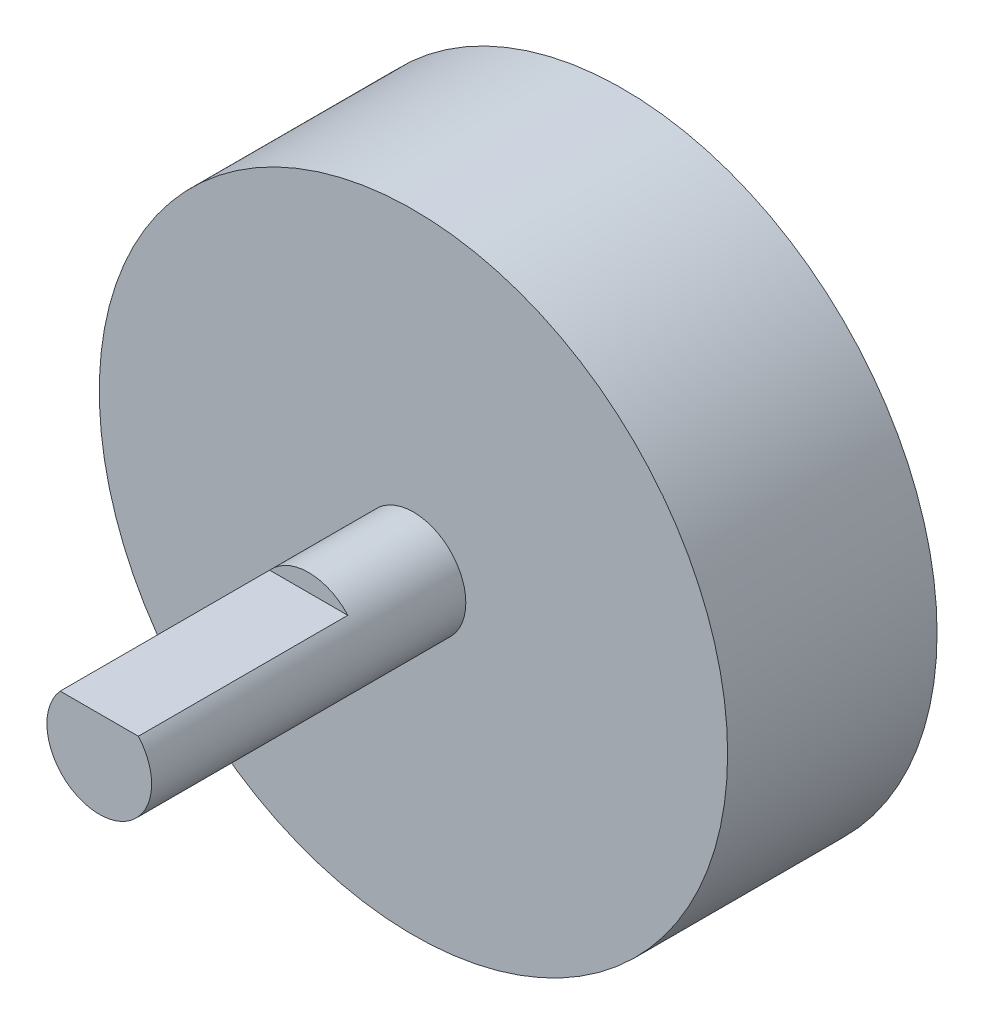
ISO-10303-21;
HEADER;
FILE_DESCRIPTION(('STEP AP214'),'2;1');
FILE_NAME('part.step','',(''),(''),'','','');
FILE_SCHEMA(('AUTOMOTIVE_DESIGN { 1 0 10303 214 1 1 1 1 }'));
ENDSEC;
DATA;
#1=APPLICATION_CONTEXT('core data for automotive mechanical design processes');
#2=APPLICATION_PROTOCOL_DEFINITION('international standard','automotive_design',2000,#1);
#3=PRODUCT_CONTEXT('',#1,'mechanical');
#4=PRODUCT('Part','Part','',(#3));
#5=PRODUCT_RELATED_PRODUCT_CATEGORY('part','',(#4));
#6=PRODUCT_DEFINITION_FORMATION('','',#4);
#7=PRODUCT_DEFINITION_CONTEXT('part definition',#1,'design');
#8=PRODUCT_DEFINITION('design','',#6,#7);
#9=PRODUCT_DEFINITION_SHAPE('','',#8);
#10=(LENGTH_UNIT() NAMED_UNIT(*) SI_UNIT(.MILLI.,.METRE.));
#11=(NAMED_UNIT(*) PLANE_ANGLE_UNIT() SI_UNIT($,.RADIAN.));
#12=(NAMED_UNIT(*) SI_UNIT($,.STERADIAN.) SOLID_ANGLE_UNIT());
#13=UNCERTAINTY_MEASURE_WITH_UNIT(LENGTH_MEASURE(1.E-05),#10,'distance_accuracy_value','');
#14=(GEOMETRIC_REPRESENTATION_CONTEXT(3) GLOBAL_UNCERTAINTY_ASSIGNED_CONTEXT((#13)) GLOBAL_UNIT_ASSIGNED_CONTEXT((#10,
#11,#12)) REPRESENTATION_CONTEXT('',''));
#15=CARTESIAN_POINT('',(0.,0.,0.));
#16=DIRECTION('',(0.,0.,1.));
#17=DIRECTION('',(1.,0.,0.));
#18=AXIS2_PLACEMENT_3D('',#15,#16,#17);
#19=CARTESIAN_POINT('',(0.,0.,12.7));
#20=DIRECTION('',(0.,0.,1.));
#21=DIRECTION('',(1.,0.,0.));
#22=AXIS2_PLACEMENT_3D('',#19,#20,#21);
#23=PLANE('',#22);
#24=CARTESIAN_POINT('',(0.,0.,12.7));
#25=DIRECTION('',(0.,0.,1.));
#26=DIRECTION('',(1.,0.,0.));
#27=AXIS2_PLACEMENT_3D('',#24,#25,#26);
#28=CIRCLE('',#27,19.05);
#29=CARTESIAN_POINT('',(19.05,0.,12.7));
#30=VERTEX_POINT('',#29);
#31=EDGE_CURVE('E62',#30,#30,#28,.T.);
#32=ORIENTED_EDGE('',*,*,#31,.T.);
#33=EDGE_LOOP('',(#32));
#34=FACE_BOUND('',#33,.T.);
#35=CARTESIAN_POINT('',(0.,0.,12.7));
#36=DIRECTION('',(0.,0.,1.));
#37=DIRECTION('',(1.,0.,0.));
#38=AXIS2_PLACEMENT_3D('',#35,#36,#37);
#39=CIRCLE('',#38,3.175);
#40=CARTESIAN_POINT('',(3.175,0.,12.7));
#41=VERTEX_POINT('',#40);
#42=EDGE_CURVE('E72',#41,#41,#39,.T.);
#43=ORIENTED_EDGE('',*,*,#42,.F.);
#44=EDGE_LOOP('',(#43));
#45=FACE_BOUND('',#44,.T.);
#46=ADVANCED_FACE('F33',(#34,#45),#23,.T.);
#47=CARTESIAN_POINT('',(0.,0.,12.7));
#48=DIRECTION('',(0.,0.,-1.));
#49=DIRECTION('',(-1.,0.,0.));
#50=AXIS2_PLACEMENT_3D('',#47,#48,#49);
#51=CYLINDRICAL_SURFACE('',#50,19.05);
#52=ORIENTED_EDGE('',*,*,#31,.F.);
#53=EDGE_LOOP('',(#52));
#54=FACE_BOUND('',#53,.T.);
#55=CARTESIAN_POINT('',(0.,0.,0.));
#56=DIRECTION('',(0.,0.,1.));
#57=DIRECTION('',(1.,0.,0.));
#58=AXIS2_PLACEMENT_3D('',#55,#56,#57);
#59=CIRCLE('',#58,19.05);
#60=CARTESIAN_POINT('',(19.05,0.,0.));
#61=VERTEX_POINT('',#60);
#62=EDGE_CURVE('E71',#61,#61,#59,.T.);
#63=ORIENTED_EDGE('',*,*,#62,.T.);
#64=EDGE_LOOP('',(#63));
#65=FACE_BOUND('',#64,.T.);
#66=ADVANCED_FACE('F35',(#54,#65),#51,.T.);
#67=CARTESIAN_POINT('',(0.,0.,0.));
#68=DIRECTION('',(0.,0.,1.));
#69=DIRECTION('',(1.,0.,0.));
#70=AXIS2_PLACEMENT_3D('',#67,#68,#69);
#71=PLANE('',#70);
#72=ORIENTED_EDGE('',*,*,#62,.F.);
#73=EDGE_LOOP('',(#72));
#74=FACE_BOUND('',#73,.T.);
#75=ADVANCED_FACE('F87',(#74),#71,.F.);
#76=CARTESIAN_POINT('',(0.,0.,31.75));
#77=DIRECTION('',(0.,0.,-1.));
#78=DIRECTION('',(-1.,0.,0.));
#79=AXIS2_PLACEMENT_3D('',#76,#77,#78);
#80=CYLINDRICAL_SURFACE('',#79,3.175);
#81=CARTESIAN_POINT('',(0.,0.,31.75));
#82=DIRECTION('',(0.,0.,1.));
#83=DIRECTION('',(1.,0.,0.));
#84=AXIS2_PLACEMENT_3D('',#81,#82,#83);
#85=CIRCLE('',#84,3.175);
#86=CARTESIAN_POINT('',(-2.37033025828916,2.11238241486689,31.75));
#87=VERTEX_POINT('',#86);
#88=CARTESIAN_POINT('',(2.37033025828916,2.11238241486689,31.75));
#89=VERTEX_POINT('',#88);
#90=EDGE_CURVE('E67',#87,#89,#85,.T.);
#91=ORIENTED_EDGE('',*,*,#90,.F.);
#92=DIRECTION('',(0.,0.,-1.));
#93=VECTOR('',#92,1.);
#94=CARTESIAN_POINT('',(-2.37033025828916,2.11238241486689,31.75));
#95=LINE('',#94,#93);
#96=CARTESIAN_POINT('',(-2.37033025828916,2.11238241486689,19.05));
#97=VERTEX_POINT('',#96);
#98=EDGE_CURVE('E48',#87,#97,#95,.T.);
#99=ORIENTED_EDGE('',*,*,#98,.T.);
#100=CARTESIAN_POINT('',(0.,0.,19.05));
#101=DIRECTION('',(0.,0.,1.));
#102=DIRECTION('',(1.,0.,0.));
#103=AXIS2_PLACEMENT_3D('',#100,#101,#102);
#104=CIRCLE('',#103,3.175);
#105=CARTESIAN_POINT('',(2.37033025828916,2.11238241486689,19.05));
#106=VERTEX_POINT('',#105);
#107=EDGE_CURVE('E11',#106,#97,#104,.T.);
#108=ORIENTED_EDGE('',*,*,#107,.F.);
#109=DIRECTION('',(0.,0.,-1.));
#110=VECTOR('',#109,1.);
#111=CARTESIAN_POINT('',(2.37033025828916,2.11238241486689,31.75));
#112=LINE('',#111,#110);
#113=EDGE_CURVE('E53',#106,#89,#112,.F.);
#114=ORIENTED_EDGE('',*,*,#113,.T.);
#115=EDGE_LOOP('',(#91,#99,#108,#114));
#116=FACE_BOUND('',#115,.T.);
#117=ORIENTED_EDGE('',*,*,#42,.T.);
#118=EDGE_LOOP('',(#117));
#119=FACE_BOUND('',#118,.T.);
#120=ADVANCED_FACE('F65',(#116,#119),#80,.T.);
#121=CARTESIAN_POINT('',(0.,0.,31.75));
#122=DIRECTION('',(0.,0.,1.));
#123=DIRECTION('',(1.,0.,0.));
#124=AXIS2_PLACEMENT_3D('',#121,#122,#123);
#125=PLANE('',#124);
#126=DIRECTION('',(1.,0.,0.));
#127=VECTOR('',#126,1.);
#128=CARTESIAN_POINT('',(0.,2.11238241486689,31.75));
#129=LINE('',#128,#127);
#130=EDGE_CURVE('E41',#87,#89,#129,.T.);
#131=ORIENTED_EDGE('',*,*,#130,.F.);
#132=ORIENTED_EDGE('',*,*,#90,.T.);
#133=EDGE_LOOP('',(#131,#132));
#134=FACE_BOUND('',#133,.T.);
#135=ADVANCED_FACE('F70',(#134),#125,.T.);
#136=CARTESIAN_POINT('',(0.,0.,19.05));
#137=DIRECTION('',(0.,0.,1.));
#138=DIRECTION('',(1.,0.,0.));
#139=AXIS2_PLACEMENT_3D('',#136,#137,#138);
#140=PLANE('',#139);
#141=ORIENTED_EDGE('',*,*,#107,.T.);
#142=DIRECTION('',(1.,0.,0.));
#143=VECTOR('',#142,1.);
#144=CARTESIAN_POINT('',(-3.63177070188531,2.11238241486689,19.05));
#145=LINE('',#144,#143);
#146=EDGE_CURVE('E68',#97,#106,#145,.T.);
#147=ORIENTED_EDGE('',*,*,#146,.T.);
#148=EDGE_LOOP('',(#141,#147));
#149=FACE_BOUND('',#148,.T.);
#150=ADVANCED_FACE('F102',(#149),#140,.T.);
#151=CARTESIAN_POINT('',(-3.63177070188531,2.11238241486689,19.05));
#152=DIRECTION('',(0.,-1.,0.));
#153=DIRECTION('',(0.,0.,-1.));
#154=AXIS2_PLACEMENT_3D('',#151,#152,#153);
#155=PLANE('',#154);
#156=ORIENTED_EDGE('',*,*,#130,.T.);
#157=ORIENTED_EDGE('',*,*,#113,.F.);
#158=ORIENTED_EDGE('',*,*,#146,.F.);
#159=ORIENTED_EDGE('',*,*,#98,.F.);
#160=EDGE_LOOP('',(#156,#157,#158,#159));
#161=FACE_BOUND('',#160,.T.);
#162=ADVANCED_FACE('F58',(#161),#155,.F.);
#163=CLOSED_SHELL('',(#46,#66,#75,#120,#135,#150,#162));
#164=MANIFOLD_SOLID_BREP('B2',#163);
#165=ADVANCED_BREP_SHAPE_REPRESENTATION('',(#18,#164),#14);
#166=SHAPE_DEFINITION_REPRESENTATION(#9,#165);
ENDSEC;
END-ISO-10303-21;
